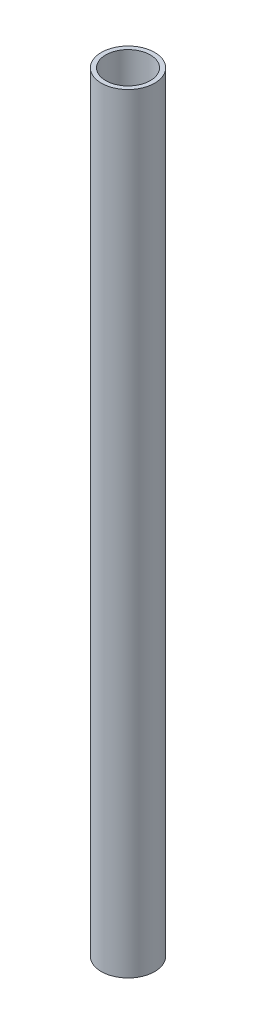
ISO-10303-21;
HEADER;
FILE_DESCRIPTION(('STEP AP214'),'2;1');
FILE_NAME('part.step','',(''),(''),'','','');
FILE_SCHEMA(('AUTOMOTIVE_DESIGN { 1 0 10303 214 1 1 1 1 }'));
ENDSEC;
DATA;
#1=APPLICATION_CONTEXT('core data for automotive mechanical design processes');
#2=APPLICATION_PROTOCOL_DEFINITION('international standard','automotive_design',2000,#1);
#3=PRODUCT_CONTEXT('',#1,'mechanical');
#4=PRODUCT('Part','Part','',(#3));
#5=PRODUCT_RELATED_PRODUCT_CATEGORY('part','',(#4));
#6=PRODUCT_DEFINITION_FORMATION('','',#4);
#7=PRODUCT_DEFINITION_CONTEXT('part definition',#1,'design');
#8=PRODUCT_DEFINITION('design','',#6,#7);
#9=PRODUCT_DEFINITION_SHAPE('','',#8);
#10=(LENGTH_UNIT() NAMED_UNIT(*) SI_UNIT(.MILLI.,.METRE.));
#11=(NAMED_UNIT(*) PLANE_ANGLE_UNIT() SI_UNIT($,.RADIAN.));
#12=(NAMED_UNIT(*) SI_UNIT($,.STERADIAN.) SOLID_ANGLE_UNIT());
#13=UNCERTAINTY_MEASURE_WITH_UNIT(LENGTH_MEASURE(1.E-05),#10,'distance_accuracy_value','');
#14=(GEOMETRIC_REPRESENTATION_CONTEXT(3) GLOBAL_UNCERTAINTY_ASSIGNED_CONTEXT((#13)) GLOBAL_UNIT_ASSIGNED_CONTEXT((#10,
#11,#12)) REPRESENTATION_CONTEXT('',''));
#15=CARTESIAN_POINT('',(0.,0.,0.));
#16=DIRECTION('',(0.,0.,1.));
#17=DIRECTION('',(1.,0.,0.));
#18=AXIS2_PLACEMENT_3D('',#15,#16,#17);
#19=CARTESIAN_POINT('',(0.,88.,0.));
#20=DIRECTION('',(0.,1.,0.));
#21=DIRECTION('',(0.,0.,1.));
#22=AXIS2_PLACEMENT_3D('',#19,#20,#21);
#23=PLANE('',#22);
#24=CARTESIAN_POINT('',(0.,88.,0.));
#25=DIRECTION('',(0.,1.,0.));
#26=DIRECTION('',(1.,0.,0.));
#27=AXIS2_PLACEMENT_3D('',#24,#25,#26);
#28=CIRCLE('',#27,3.05);
#29=CARTESIAN_POINT('',(3.05,88.,0.));
#30=VERTEX_POINT('',#29);
#31=EDGE_CURVE('E11',#30,#30,#28,.T.);
#32=ORIENTED_EDGE('',*,*,#31,.T.);
#33=EDGE_LOOP('',(#32));
#34=FACE_BOUND('',#33,.T.);
#35=CARTESIAN_POINT('',(0.,88.,0.));
#36=DIRECTION('',(0.,1.,0.));
#37=DIRECTION('',(0.,0.,1.));
#38=AXIS2_PLACEMENT_3D('',#35,#36,#37);
#39=CIRCLE('',#38,2.55);
#40=CARTESIAN_POINT('',(0.,88.,2.55));
#41=VERTEX_POINT('',#40);
#42=EDGE_CURVE('E50',#41,#41,#39,.T.);
#43=ORIENTED_EDGE('',*,*,#42,.F.);
#44=EDGE_LOOP('',(#43));
#45=FACE_BOUND('',#44,.T.);
#46=ADVANCED_FACE('F39',(#34,#45),#23,.T.);
#47=CARTESIAN_POINT('',(0.,0.,0.));
#48=DIRECTION('',(0.,1.,0.));
#49=DIRECTION('',(0.,0.,1.));
#50=AXIS2_PLACEMENT_3D('',#47,#48,#49);
#51=PLANE('',#50);
#52=CARTESIAN_POINT('',(0.,0.,0.));
#53=DIRECTION('',(0.,1.,0.));
#54=DIRECTION('',(1.,0.,0.));
#55=AXIS2_PLACEMENT_3D('',#52,#53,#54);
#56=CIRCLE('',#55,3.05);
#57=CARTESIAN_POINT('',(3.05,0.,0.));
#58=VERTEX_POINT('',#57);
#59=EDGE_CURVE('E43',#58,#58,#56,.T.);
#60=ORIENTED_EDGE('',*,*,#59,.F.);
#61=EDGE_LOOP('',(#60));
#62=FACE_BOUND('',#61,.T.);
#63=CARTESIAN_POINT('',(0.,0.,0.));
#64=DIRECTION('',(0.,1.,0.));
#65=DIRECTION('',(0.,0.,1.));
#66=AXIS2_PLACEMENT_3D('',#63,#64,#65);
#67=CIRCLE('',#66,2.55);
#68=CARTESIAN_POINT('',(0.,0.,2.55));
#69=VERTEX_POINT('',#68);
#70=EDGE_CURVE('E52',#69,#69,#67,.T.);
#71=ORIENTED_EDGE('',*,*,#70,.T.);
#72=EDGE_LOOP('',(#71));
#73=FACE_BOUND('',#72,.T.);
#74=ADVANCED_FACE('F62',(#62,#73),#51,.F.);
#75=CARTESIAN_POINT('',(0.,88.,0.));
#76=DIRECTION('',(0.,-1.,0.));
#77=DIRECTION('',(0.,0.,-1.));
#78=AXIS2_PLACEMENT_3D('',#75,#76,#77);
#79=CYLINDRICAL_SURFACE('',#78,3.05);
#80=ORIENTED_EDGE('',*,*,#31,.F.);
#81=EDGE_LOOP('',(#80));
#82=FACE_BOUND('',#81,.T.);
#83=ORIENTED_EDGE('',*,*,#59,.T.);
#84=EDGE_LOOP('',(#83));
#85=FACE_BOUND('',#84,.T.);
#86=ADVANCED_FACE('F41',(#82,#85),#79,.T.);
#87=CARTESIAN_POINT('',(0.,88.,0.));
#88=DIRECTION('',(0.,-1.,0.));
#89=DIRECTION('',(0.,0.,-1.));
#90=AXIS2_PLACEMENT_3D('',#87,#88,#89);
#91=CYLINDRICAL_SURFACE('',#90,2.55);
#92=ORIENTED_EDGE('',*,*,#42,.T.);
#93=EDGE_LOOP('',(#92));
#94=FACE_BOUND('',#93,.T.);
#95=ORIENTED_EDGE('',*,*,#70,.F.);
#96=EDGE_LOOP('',(#95));
#97=FACE_BOUND('',#96,.T.);
#98=ADVANCED_FACE('F58',(#94,#97),#91,.F.);
#99=CLOSED_SHELL('',(#46,#74,#86,#98));
#100=MANIFOLD_SOLID_BREP('B2',#99);
#101=ADVANCED_BREP_SHAPE_REPRESENTATION('',(#18,#100),#14);
#102=SHAPE_DEFINITION_REPRESENTATION(#9,#101);
ENDSEC;
END-ISO-10303-21;
